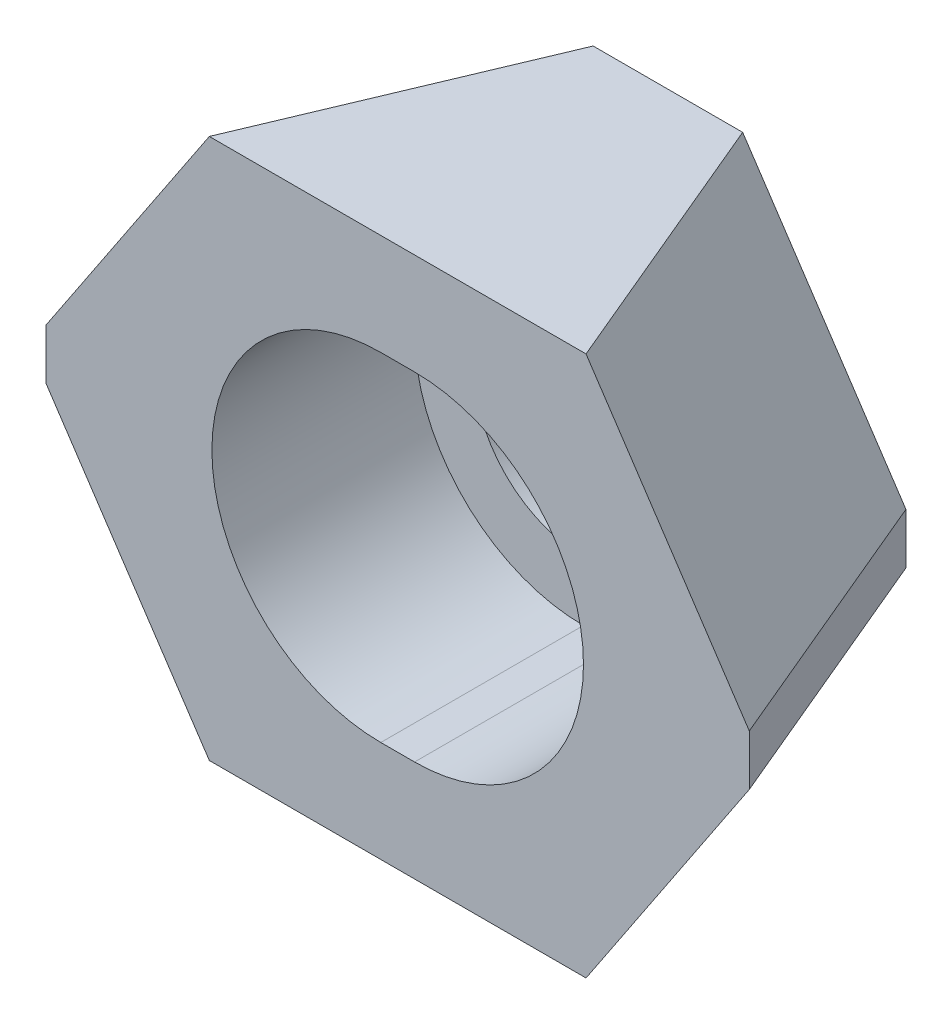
ISO-10303-21;
HEADER;
FILE_DESCRIPTION(('STEP AP214'),'2;1');
FILE_NAME('part.step','',(''),(''),'','','');
FILE_SCHEMA(('AUTOMOTIVE_DESIGN { 1 0 10303 214 1 1 1 1 }'));
ENDSEC;
DATA;
#1=APPLICATION_CONTEXT('core data for automotive mechanical design processes');
#2=APPLICATION_PROTOCOL_DEFINITION('international standard','automotive_design',2000,#1);
#3=PRODUCT_CONTEXT('',#1,'mechanical');
#4=PRODUCT('Part','Part','',(#3));
#5=PRODUCT_RELATED_PRODUCT_CATEGORY('part','',(#4));
#6=PRODUCT_DEFINITION_FORMATION('','',#4);
#7=PRODUCT_DEFINITION_CONTEXT('part definition',#1,'design');
#8=PRODUCT_DEFINITION('design','',#6,#7);
#9=PRODUCT_DEFINITION_SHAPE('','',#8);
#10=(LENGTH_UNIT() NAMED_UNIT(*) SI_UNIT(.MILLI.,.METRE.));
#11=(NAMED_UNIT(*) PLANE_ANGLE_UNIT() SI_UNIT($,.RADIAN.));
#12=(NAMED_UNIT(*) SI_UNIT($,.STERADIAN.) SOLID_ANGLE_UNIT());
#13=UNCERTAINTY_MEASURE_WITH_UNIT(LENGTH_MEASURE(1.E-05),#10,'distance_accuracy_value','');
#14=(GEOMETRIC_REPRESENTATION_CONTEXT(3) GLOBAL_UNCERTAINTY_ASSIGNED_CONTEXT((#13)) GLOBAL_UNIT_ASSIGNED_CONTEXT((#10,
#11,#12)) REPRESENTATION_CONTEXT('',''));
#15=CARTESIAN_POINT('',(0.,0.,0.));
#16=DIRECTION('',(0.,0.,1.));
#17=DIRECTION('',(1.,0.,0.));
#18=AXIS2_PLACEMENT_3D('',#15,#16,#17);
#19=CARTESIAN_POINT('',(-5.09277413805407,15.,0.));
#20=DIRECTION('',(0.,0.,-1.));
#21=DIRECTION('',(0.,1.,0.));
#22=AXIS2_PLACEMENT_3D('',#19,#20,#21);
#23=PLANE('',#22);
#24=DIRECTION('',(-0.554700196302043,-0.832050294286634,0.));
#25=VECTOR('',#24,1.);
#26=CARTESIAN_POINT('',(-5.09277413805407,15.,0.));
#27=LINE('',#26,#25);
#28=CARTESIAN_POINT('',(-4.42610747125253,16.,0.));
#29=VERTEX_POINT('',#28);
#30=CARTESIAN_POINT('',(-14.0927741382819,1.5,0.));
#31=VERTEX_POINT('',#30);
#32=EDGE_CURVE('E127',#29,#31,#27,.T.);
#33=ORIENTED_EDGE('',*,*,#32,.F.);
#34=DIRECTION('',(-1.,0.,0.));
#35=VECTOR('',#34,1.);
#36=CARTESIAN_POINT('',(5.09277413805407,16.,0.));
#37=LINE('',#36,#35);
#38=CARTESIAN_POINT('',(4.42610747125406,16.,0.));
#39=VERTEX_POINT('',#38);
#40=EDGE_CURVE('E130',#39,#29,#37,.T.);
#41=ORIENTED_EDGE('',*,*,#40,.F.);
#42=DIRECTION('',(0.554700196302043,-0.832050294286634,0.));
#43=VECTOR('',#42,1.);
#44=CARTESIAN_POINT('',(5.09277413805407,15.,0.));
#45=LINE('',#44,#43);
#46=CARTESIAN_POINT('',(14.0927741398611,1.5,0.));
#47=VERTEX_POINT('',#46);
#48=EDGE_CURVE('E35',#39,#47,#45,.T.);
#49=ORIENTED_EDGE('',*,*,#48,.T.);
#50=DIRECTION('',(0.,1.,0.));
#51=VECTOR('',#50,1.);
#52=CARTESIAN_POINT('',(14.0927741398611,-1.5,0.));
#53=LINE('',#52,#51);
#54=CARTESIAN_POINT('',(14.0927741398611,-1.5,0.));
#55=VERTEX_POINT('',#54);
#56=EDGE_CURVE('E233',#55,#47,#53,.T.);
#57=ORIENTED_EDGE('',*,*,#56,.F.);
#58=DIRECTION('',(-0.554700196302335,-0.83205029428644,0.));
#59=VECTOR('',#58,1.);
#60=CARTESIAN_POINT('',(14.0927741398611,-1.5,0.));
#61=LINE('',#60,#59);
#62=CARTESIAN_POINT('',(4.42610747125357,-16.,0.));
#63=VERTEX_POINT('',#62);
#64=EDGE_CURVE('E218',#55,#63,#61,.T.);
#65=ORIENTED_EDGE('',*,*,#64,.T.);
#66=DIRECTION('',(1.,0.,0.));
#67=VECTOR('',#66,1.);
#68=CARTESIAN_POINT('',(-5.09277413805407,-16.,0.));
#69=LINE('',#68,#67);
#70=CARTESIAN_POINT('',(-4.4261074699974,-16.,0.));
#71=VERTEX_POINT('',#70);
#72=EDGE_CURVE('E141',#71,#63,#69,.T.);
#73=ORIENTED_EDGE('',*,*,#72,.F.);
#74=DIRECTION('',(0.554700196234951,-0.832050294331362,0.));
#75=VECTOR('',#74,1.);
#76=CARTESIAN_POINT('',(-14.0927741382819,-1.5,0.));
#77=LINE('',#76,#75);
#78=CARTESIAN_POINT('',(-14.0927741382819,-1.5,0.));
#79=VERTEX_POINT('',#78);
#80=EDGE_CURVE('E217',#79,#71,#77,.T.);
#81=ORIENTED_EDGE('',*,*,#80,.F.);
#82=DIRECTION('',(0.,1.,0.));
#83=VECTOR('',#82,1.);
#84=CARTESIAN_POINT('',(-14.0927741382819,-1.5,0.));
#85=LINE('',#84,#83);
#86=EDGE_CURVE('E132',#79,#31,#85,.T.);
#87=ORIENTED_EDGE('',*,*,#86,.T.);
#88=EDGE_LOOP('',(#33,#41,#49,#57,#65,#73,#81,#87));
#89=FACE_BOUND('',#88,.T.);
#90=CARTESIAN_POINT('',(-1.,0.,0.));
#91=DIRECTION('',(0.,0.,1.));
#92=DIRECTION('',(1.,0.,0.));
#93=AXIS2_PLACEMENT_3D('',#90,#91,#92);
#94=CIRCLE('',#93,6.5);
#95=CARTESIAN_POINT('',(-1.,6.5,0.));
#96=VERTEX_POINT('',#95);
#97=CARTESIAN_POINT('',(-1.,-6.5,0.));
#98=VERTEX_POINT('',#97);
#99=EDGE_CURVE('E189',#96,#98,#94,.T.);
#100=ORIENTED_EDGE('',*,*,#99,.T.);
#101=DIRECTION('',(1.,0.,0.));
#102=VECTOR('',#101,1.);
#103=CARTESIAN_POINT('',(-1.,-6.5,0.));
#104=LINE('',#103,#102);
#105=CARTESIAN_POINT('',(1.00000000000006,-6.5,0.));
#106=VERTEX_POINT('',#105);
#107=EDGE_CURVE('E193',#98,#106,#104,.T.);
#108=ORIENTED_EDGE('',*,*,#107,.T.);
#109=CARTESIAN_POINT('',(1.,0.,0.));
#110=DIRECTION('',(0.,0.,1.));
#111=DIRECTION('',(1.,0.,0.));
#112=AXIS2_PLACEMENT_3D('',#109,#110,#111);
#113=CIRCLE('',#112,6.5);
#114=CARTESIAN_POINT('',(1.,6.5,0.));
#115=VERTEX_POINT('',#114);
#116=EDGE_CURVE('E196',#106,#115,#113,.T.);
#117=ORIENTED_EDGE('',*,*,#116,.T.);
#118=DIRECTION('',(1.,0.,0.));
#119=VECTOR('',#118,1.);
#120=CARTESIAN_POINT('',(-1.,6.5,0.));
#121=LINE('',#120,#119);
#122=EDGE_CURVE('E188',#96,#115,#121,.T.);
#123=ORIENTED_EDGE('',*,*,#122,.F.);
#124=EDGE_LOOP('',(#100,#108,#117,#123));
#125=FACE_BOUND('',#124,.T.);
#126=ADVANCED_FACE('F14',(#89,#125),#23,.T.);
#127=CARTESIAN_POINT('',(11.8185548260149,15.,16.));
#128=DIRECTION('',(0.,0.,1.));
#129=DIRECTION('',(1.,0.,0.));
#130=AXIS2_PLACEMENT_3D('',#127,#128,#129);
#131=PLANE('',#130);
#132=DIRECTION('',(1.,0.,0.));
#133=VECTOR('',#132,1.);
#134=CARTESIAN_POINT('',(-11.8185548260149,16.,16.));
#135=LINE('',#134,#133);
#136=CARTESIAN_POINT('',(-11.1518881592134,16.,16.));
#137=VERTEX_POINT('',#136);
#138=CARTESIAN_POINT('',(11.1518881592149,16.,16.));
#139=VERTEX_POINT('',#138);
#140=EDGE_CURVE('E140',#137,#139,#135,.T.);
#141=ORIENTED_EDGE('',*,*,#140,.F.);
#142=DIRECTION('',(-0.55470019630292,-0.83205029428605,0.));
#143=VECTOR('',#142,1.);
#144=CARTESIAN_POINT('',(-11.8185548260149,15.,16.));
#145=LINE('',#144,#143);
#146=CARTESIAN_POINT('',(-20.8185548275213,1.5,16.));
#147=VERTEX_POINT('',#146);
#148=EDGE_CURVE('E27',#137,#147,#145,.T.);
#149=ORIENTED_EDGE('',*,*,#148,.T.);
#150=DIRECTION('',(0.,1.,0.));
#151=VECTOR('',#150,1.);
#152=CARTESIAN_POINT('',(-20.8185548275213,-1.5,16.));
#153=LINE('',#152,#151);
#154=CARTESIAN_POINT('',(-20.8185548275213,-1.5,16.));
#155=VERTEX_POINT('',#154);
#156=EDGE_CURVE('E225',#155,#147,#153,.T.);
#157=ORIENTED_EDGE('',*,*,#156,.F.);
#158=DIRECTION('',(0.554700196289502,-0.832050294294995,0.));
#159=VECTOR('',#158,1.);
#160=CARTESIAN_POINT('',(-20.8185548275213,-1.5,16.));
#161=LINE('',#160,#159);
#162=CARTESIAN_POINT('',(-11.1518881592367,-16.,16.));
#163=VERTEX_POINT('',#162);
#164=EDGE_CURVE('E212',#155,#163,#161,.T.);
#165=ORIENTED_EDGE('',*,*,#164,.T.);
#166=DIRECTION('',(-1.,0.,0.));
#167=VECTOR('',#166,1.);
#168=CARTESIAN_POINT('',(11.8185548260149,-16.,16.));
#169=LINE('',#168,#167);
#170=CARTESIAN_POINT('',(11.1518881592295,-16.,16.));
#171=VERTEX_POINT('',#170);
#172=EDGE_CURVE('E146',#171,#163,#169,.T.);
#173=ORIENTED_EDGE('',*,*,#172,.F.);
#174=DIRECTION('',(-0.554700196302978,-0.832050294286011,0.));
#175=VECTOR('',#174,1.);
#176=CARTESIAN_POINT('',(20.8185548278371,-1.5,16.));
#177=LINE('',#176,#175);
#178=CARTESIAN_POINT('',(20.8185548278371,-1.5,16.));
#179=VERTEX_POINT('',#178);
#180=EDGE_CURVE('E215',#179,#171,#177,.T.);
#181=ORIENTED_EDGE('',*,*,#180,.F.);
#182=DIRECTION('',(0.,1.,0.));
#183=VECTOR('',#182,1.);
#184=CARTESIAN_POINT('',(20.8185548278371,-1.5,16.));
#185=LINE('',#184,#183);
#186=CARTESIAN_POINT('',(20.8185548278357,1.5,16.));
#187=VERTEX_POINT('',#186);
#188=EDGE_CURVE('E230',#179,#187,#185,.T.);
#189=ORIENTED_EDGE('',*,*,#188,.T.);
#190=DIRECTION('',(0.55470019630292,-0.83205029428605,0.));
#191=VECTOR('',#190,1.);
#192=CARTESIAN_POINT('',(11.8185548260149,15.,16.));
#193=LINE('',#192,#191);
#194=EDGE_CURVE('E134',#139,#187,#193,.T.);
#195=ORIENTED_EDGE('',*,*,#194,.F.);
#196=EDGE_LOOP('',(#141,#149,#157,#165,#173,#181,#189,#195));
#197=FACE_BOUND('',#196,.T.);
#198=CARTESIAN_POINT('',(-1.,0.,16.));
#199=DIRECTION('',(0.,0.,1.));
#200=DIRECTION('',(1.,0.,0.));
#201=AXIS2_PLACEMENT_3D('',#198,#199,#200);
#202=CIRCLE('',#201,10.);
#203=CARTESIAN_POINT('',(-1.,10.,16.));
#204=VERTEX_POINT('',#203);
#205=CARTESIAN_POINT('',(-1.,-10.,16.));
#206=VERTEX_POINT('',#205);
#207=EDGE_CURVE('E150',#204,#206,#202,.T.);
#208=ORIENTED_EDGE('',*,*,#207,.F.);
#209=DIRECTION('',(1.,0.,0.));
#210=VECTOR('',#209,1.);
#211=CARTESIAN_POINT('',(-1.,10.,16.));
#212=LINE('',#211,#210);
#213=CARTESIAN_POINT('',(1.,10.,16.));
#214=VERTEX_POINT('',#213);
#215=EDGE_CURVE('E143',#204,#214,#212,.T.);
#216=ORIENTED_EDGE('',*,*,#215,.T.);
#217=CARTESIAN_POINT('',(1.,0.,16.));
#218=DIRECTION('',(0.,0.,1.));
#219=DIRECTION('',(1.,0.,0.));
#220=AXIS2_PLACEMENT_3D('',#217,#218,#219);
#221=CIRCLE('',#220,10.);
#222=CARTESIAN_POINT('',(1.,-10.,16.));
#223=VERTEX_POINT('',#222);
#224=EDGE_CURVE('E156',#223,#214,#221,.T.);
#225=ORIENTED_EDGE('',*,*,#224,.F.);
#226=DIRECTION('',(1.,0.,0.));
#227=VECTOR('',#226,1.);
#228=CARTESIAN_POINT('',(-1.,-10.,16.));
#229=LINE('',#228,#227);
#230=EDGE_CURVE('E153',#206,#223,#229,.T.);
#231=ORIENTED_EDGE('',*,*,#230,.F.);
#232=EDGE_LOOP('',(#208,#216,#225,#231));
#233=FACE_BOUND('',#232,.T.);
#234=ADVANCED_FACE('F259',(#197,#233),#131,.T.);
#235=CARTESIAN_POINT('',(0.,-16.,0.));
#236=DIRECTION('',(0.,-1.,0.));
#237=DIRECTION('',(0.,0.,-1.));
#238=AXIS2_PLACEMENT_3D('',#235,#236,#237);
#239=PLANE('',#238);
#240=ORIENTED_EDGE('',*,*,#72,.T.);
#241=DIRECTION('',(0.38751558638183,0.,0.921863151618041));
#242=VECTOR('',#241,1.);
#243=CARTESIAN_POINT('',(3.76144630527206,-16.,-1.58116643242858));
#244=LINE('',#243,#242);
#245=EDGE_CURVE('E249',#63,#171,#244,.T.);
#246=ORIENTED_EDGE('',*,*,#245,.T.);
#247=ORIENTED_EDGE('',*,*,#172,.T.);
#248=DIRECTION('',(-0.387515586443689,0.,0.921863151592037));
#249=VECTOR('',#248,1.);
#250=CARTESIAN_POINT('',(-3.76144630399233,-16.,-1.58116643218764));
#251=LINE('',#250,#249);
#252=EDGE_CURVE('E246',#71,#163,#251,.T.);
#253=ORIENTED_EDGE('',*,*,#252,.F.);
#254=EDGE_LOOP('',(#240,#246,#247,#253));
#255=FACE_BOUND('',#254,.T.);
#256=ADVANCED_FACE('F269',(#255),#239,.T.);
#257=CARTESIAN_POINT('',(-1.,0.,0.));
#258=DIRECTION('',(0.,0.,1.));
#259=DIRECTION('',(1.,0.,0.));
#260=AXIS2_PLACEMENT_3D('',#257,#258,#259);
#261=CYLINDRICAL_SURFACE('',#260,6.5);
#262=CARTESIAN_POINT('',(-1.,0.,4.));
#263=DIRECTION('',(0.,0.,1.));
#264=DIRECTION('',(1.,0.,0.));
#265=AXIS2_PLACEMENT_3D('',#262,#263,#264);
#266=CIRCLE('',#265,6.5);
#267=CARTESIAN_POINT('',(-1.,-6.5,4.));
#268=VERTEX_POINT('',#267);
#269=CARTESIAN_POINT('',(-1.,6.5,4.));
#270=VERTEX_POINT('',#269);
#271=EDGE_CURVE('E186',#268,#270,#266,.F.);
#272=ORIENTED_EDGE('',*,*,#271,.F.);
#273=DIRECTION('',(0.,0.,1.));
#274=VECTOR('',#273,1.);
#275=CARTESIAN_POINT('',(-1.,-6.5,0.));
#276=LINE('',#275,#274);
#277=EDGE_CURVE('E192',#98,#268,#276,.T.);
#278=ORIENTED_EDGE('',*,*,#277,.F.);
#279=ORIENTED_EDGE('',*,*,#99,.F.);
#280=DIRECTION('',(0.,0.,1.));
#281=VECTOR('',#280,1.);
#282=CARTESIAN_POINT('',(-1.,6.5,0.));
#283=LINE('',#282,#281);
#284=EDGE_CURVE('E209',#96,#270,#283,.T.);
#285=ORIENTED_EDGE('',*,*,#284,.T.);
#286=EDGE_LOOP('',(#272,#278,#279,#285));
#287=FACE_BOUND('',#286,.T.);
#288=ADVANCED_FACE('F299',(#287),#261,.F.);
#289=CARTESIAN_POINT('',(-1.,6.5,0.));
#290=DIRECTION('',(0.,-1.,0.));
#291=DIRECTION('',(1.,0.,0.));
#292=AXIS2_PLACEMENT_3D('',#289,#290,#291);
#293=PLANE('',#292);
#294=DIRECTION('',(0.,0.,1.));
#295=VECTOR('',#294,1.);
#296=CARTESIAN_POINT('',(1.,6.5,0.));
#297=LINE('',#296,#295);
#298=CARTESIAN_POINT('',(1.,6.5,4.));
#299=VERTEX_POINT('',#298);
#300=EDGE_CURVE('E206',#115,#299,#297,.T.);
#301=ORIENTED_EDGE('',*,*,#300,.T.);
#302=DIRECTION('',(-1.,0.,0.));
#303=VECTOR('',#302,1.);
#304=CARTESIAN_POINT('',(-1.,6.5,4.));
#305=LINE('',#304,#303);
#306=EDGE_CURVE('E183',#299,#270,#305,.T.);
#307=ORIENTED_EDGE('',*,*,#306,.T.);
#308=ORIENTED_EDGE('',*,*,#284,.F.);
#309=ORIENTED_EDGE('',*,*,#122,.T.);
#310=EDGE_LOOP('',(#301,#307,#308,#309));
#311=FACE_BOUND('',#310,.T.);
#312=ADVANCED_FACE('F305',(#311),#293,.T.);
#313=CARTESIAN_POINT('',(1.,0.,0.));
#314=DIRECTION('',(0.,0.,1.));
#315=DIRECTION('',(1.,0.,0.));
#316=AXIS2_PLACEMENT_3D('',#313,#314,#315);
#317=CYLINDRICAL_SURFACE('',#316,6.5);
#318=CARTESIAN_POINT('',(1.,0.,4.));
#319=DIRECTION('',(0.,0.,1.));
#320=DIRECTION('',(1.,0.,0.));
#321=AXIS2_PLACEMENT_3D('',#318,#319,#320);
#322=CIRCLE('',#321,6.5);
#323=CARTESIAN_POINT('',(1.00000000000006,-6.5,4.));
#324=VERTEX_POINT('',#323);
#325=EDGE_CURVE('E181',#299,#324,#322,.F.);
#326=ORIENTED_EDGE('',*,*,#325,.F.);
#327=ORIENTED_EDGE('',*,*,#300,.F.);
#328=ORIENTED_EDGE('',*,*,#116,.F.);
#329=DIRECTION('',(0.,0.,1.));
#330=VECTOR('',#329,1.);
#331=CARTESIAN_POINT('',(1.00000000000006,-6.5,0.));
#332=LINE('',#331,#330);
#333=EDGE_CURVE('E203',#106,#324,#332,.T.);
#334=ORIENTED_EDGE('',*,*,#333,.T.);
#335=EDGE_LOOP('',(#326,#327,#328,#334));
#336=FACE_BOUND('',#335,.T.);
#337=ADVANCED_FACE('F333',(#336),#317,.F.);
#338=CARTESIAN_POINT('',(-1.,-6.5,0.));
#339=DIRECTION('',(0.,-1.,0.));
#340=DIRECTION('',(1.,0.,0.));
#341=AXIS2_PLACEMENT_3D('',#338,#339,#340);
#342=PLANE('',#341);
#343=DIRECTION('',(-1.,0.,0.));
#344=VECTOR('',#343,1.);
#345=CARTESIAN_POINT('',(-1.,-6.5,4.));
#346=LINE('',#345,#344);
#347=EDGE_CURVE('E243',#324,#268,#346,.T.);
#348=ORIENTED_EDGE('',*,*,#347,.F.);
#349=ORIENTED_EDGE('',*,*,#333,.F.);
#350=ORIENTED_EDGE('',*,*,#107,.F.);
#351=ORIENTED_EDGE('',*,*,#277,.T.);
#352=EDGE_LOOP('',(#348,#349,#350,#351));
#353=FACE_BOUND('',#352,.T.);
#354=ADVANCED_FACE('F286',(#353),#342,.F.);
#355=CARTESIAN_POINT('',(5.09277413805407,15.,0.));
#356=DIRECTION('',(0.785395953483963,0.523597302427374,-0.330150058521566));
#357=DIRECTION('',(-0.554700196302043,0.832050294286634,0.));
#358=AXIS2_PLACEMENT_3D('',#355,#356,#357);
#359=PLANE('',#358);
#360=ORIENTED_EDGE('',*,*,#194,.T.);
#361=DIRECTION('',(-0.387515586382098,0.,-0.921863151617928));
#362=VECTOR('',#361,1.);
#363=CARTESIAN_POINT('',(20.8185548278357,1.5,16.));
#364=LINE('',#363,#362);
#365=EDGE_CURVE('E238',#187,#47,#364,.T.);
#366=ORIENTED_EDGE('',*,*,#365,.T.);
#367=ORIENTED_EDGE('',*,*,#48,.F.);
#368=DIRECTION('',(0.387515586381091,0.,0.921863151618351));
#369=VECTOR('',#368,1.);
#370=CARTESIAN_POINT('',(3.76144630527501,16.,-1.58116643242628));
#371=LINE('',#370,#369);
#372=EDGE_CURVE('E21',#39,#139,#371,.T.);
#373=ORIENTED_EDGE('',*,*,#372,.T.);
#374=EDGE_LOOP('',(#360,#366,#367,#373));
#375=FACE_BOUND('',#374,.T.);
#376=ADVANCED_FACE('F251',(#375),#359,.T.);
#377=CARTESIAN_POINT('',(-11.8185548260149,15.,16.));
#378=DIRECTION('',(-0.785395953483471,0.523597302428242,-0.33015005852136));
#379=DIRECTION('',(-0.55470019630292,-0.83205029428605,0.));
#380=AXIS2_PLACEMENT_3D('',#377,#378,#379);
#381=PLANE('',#380);
#382=ORIENTED_EDGE('',*,*,#32,.T.);
#383=DIRECTION('',(0.387515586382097,0.,-0.921863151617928));
#384=VECTOR('',#383,1.);
#385=CARTESIAN_POINT('',(-20.8185548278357,1.5,16.));
#386=LINE('',#385,#384);
#387=EDGE_CURVE('E237',#147,#31,#386,.T.);
#388=ORIENTED_EDGE('',*,*,#387,.F.);
#389=ORIENTED_EDGE('',*,*,#148,.F.);
#390=DIRECTION('',(0.387515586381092,0.,-0.921863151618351));
#391=VECTOR('',#390,1.);
#392=CARTESIAN_POINT('',(-3.76144630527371,16.,-1.58116643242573));
#393=LINE('',#392,#391);
#394=EDGE_CURVE('E9',#137,#29,#393,.T.);
#395=ORIENTED_EDGE('',*,*,#394,.T.);
#396=EDGE_LOOP('',(#382,#388,#389,#395));
#397=FACE_BOUND('',#396,.T.);
#398=ADVANCED_FACE('F136',(#397),#381,.T.);
#399=CARTESIAN_POINT('',(-20.8185548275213,-1.5,16.));
#400=DIRECTION('',(0.921863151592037,0.,0.387515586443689));
#401=DIRECTION('',(0.387515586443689,0.,-0.921863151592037));
#402=AXIS2_PLACEMENT_3D('',#399,#400,#401);
#403=PLANE('',#402);
#404=ORIENTED_EDGE('',*,*,#86,.F.);
#405=DIRECTION('',(0.387515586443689,0.,-0.921863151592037));
#406=VECTOR('',#405,1.);
#407=CARTESIAN_POINT('',(-20.8185548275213,-1.5,16.));
#408=LINE('',#407,#406);
#409=EDGE_CURVE('E222',#155,#79,#408,.T.);
#410=ORIENTED_EDGE('',*,*,#409,.F.);
#411=ORIENTED_EDGE('',*,*,#156,.T.);
#412=ORIENTED_EDGE('',*,*,#387,.T.);
#413=EDGE_LOOP('',(#404,#410,#411,#412));
#414=FACE_BOUND('',#413,.T.);
#415=ADVANCED_FACE('F275',(#414),#403,.F.);
#416=CARTESIAN_POINT('',(20.8185548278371,-1.5,16.));
#417=DIRECTION('',(0.92186315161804,0.,-0.38751558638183));
#418=DIRECTION('',(-0.38751558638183,0.,-0.921863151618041));
#419=AXIS2_PLACEMENT_3D('',#416,#417,#418);
#420=PLANE('',#419);
#421=ORIENTED_EDGE('',*,*,#188,.F.);
#422=DIRECTION('',(-0.38751558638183,0.,-0.921863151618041));
#423=VECTOR('',#422,1.);
#424=CARTESIAN_POINT('',(20.8185548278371,-1.5,16.));
#425=LINE('',#424,#423);
#426=EDGE_CURVE('E220',#179,#55,#425,.T.);
#427=ORIENTED_EDGE('',*,*,#426,.T.);
#428=ORIENTED_EDGE('',*,*,#56,.T.);
#429=ORIENTED_EDGE('',*,*,#365,.F.);
#430=EDGE_LOOP('',(#421,#427,#428,#429));
#431=FACE_BOUND('',#430,.T.);
#432=ADVANCED_FACE('F257',(#431),#420,.T.);
#433=CARTESIAN_POINT('',(14.0927741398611,-1.5,0.));
#434=DIRECTION('',(0.785395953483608,-0.523597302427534,-0.330150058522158));
#435=DIRECTION('',(0.554700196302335,0.83205029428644,0.));
#436=AXIS2_PLACEMENT_3D('',#433,#434,#435);
#437=PLANE('',#436);
#438=ORIENTED_EDGE('',*,*,#245,.F.);
#439=ORIENTED_EDGE('',*,*,#64,.F.);
#440=ORIENTED_EDGE('',*,*,#426,.F.);
#441=ORIENTED_EDGE('',*,*,#180,.T.);
#442=EDGE_LOOP('',(#438,#439,#440,#441));
#443=FACE_BOUND('',#442,.T.);
#444=ADVANCED_FACE('F265',(#443),#437,.T.);
#445=CARTESIAN_POINT('',(-20.8185548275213,-1.5,16.));
#446=DIRECTION('',(-0.785395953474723,-0.523597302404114,-0.330150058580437));
#447=DIRECTION('',(0.554700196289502,-0.832050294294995,0.));
#448=AXIS2_PLACEMENT_3D('',#445,#446,#447);
#449=PLANE('',#448);
#450=ORIENTED_EDGE('',*,*,#252,.T.);
#451=ORIENTED_EDGE('',*,*,#164,.F.);
#452=ORIENTED_EDGE('',*,*,#409,.T.);
#453=ORIENTED_EDGE('',*,*,#80,.T.);
#454=EDGE_LOOP('',(#450,#451,#452,#453));
#455=FACE_BOUND('',#454,.T.);
#456=ADVANCED_FACE('F271',(#455),#449,.T.);
#457=CARTESIAN_POINT('',(-1.,0.,4.));
#458=DIRECTION('',(0.,0.,1.));
#459=DIRECTION('',(1.,0.,0.));
#460=AXIS2_PLACEMENT_3D('',#457,#458,#459);
#461=PLANE('',#460);
#462=CARTESIAN_POINT('',(-1.,0.,4.));
#463=DIRECTION('',(0.,0.,1.));
#464=DIRECTION('',(1.,0.,0.));
#465=AXIS2_PLACEMENT_3D('',#462,#463,#464);
#466=CIRCLE('',#465,10.);
#467=CARTESIAN_POINT('',(-1.,10.,4.));
#468=VERTEX_POINT('',#467);
#469=CARTESIAN_POINT('',(-1.,-10.,4.));
#470=VERTEX_POINT('',#469);
#471=EDGE_CURVE('E161',#468,#470,#466,.T.);
#472=ORIENTED_EDGE('',*,*,#471,.T.);
#473=DIRECTION('',(1.,0.,0.));
#474=VECTOR('',#473,1.);
#475=CARTESIAN_POINT('',(-1.,-10.,4.));
#476=LINE('',#475,#474);
#477=CARTESIAN_POINT('',(1.,-10.,4.));
#478=VERTEX_POINT('',#477);
#479=EDGE_CURVE('E165',#470,#478,#476,.T.);
#480=ORIENTED_EDGE('',*,*,#479,.T.);
#481=CARTESIAN_POINT('',(1.,0.,4.));
#482=DIRECTION('',(0.,0.,1.));
#483=DIRECTION('',(1.,0.,0.));
#484=AXIS2_PLACEMENT_3D('',#481,#482,#483);
#485=CIRCLE('',#484,10.);
#486=CARTESIAN_POINT('',(1.,10.,4.));
#487=VERTEX_POINT('',#486);
#488=EDGE_CURVE('E168',#478,#487,#485,.T.);
#489=ORIENTED_EDGE('',*,*,#488,.T.);
#490=DIRECTION('',(1.,0.,0.));
#491=VECTOR('',#490,1.);
#492=CARTESIAN_POINT('',(-1.,10.,4.));
#493=LINE('',#492,#491);
#494=EDGE_CURVE('E152',#468,#487,#493,.T.);
#495=ORIENTED_EDGE('',*,*,#494,.F.);
#496=EDGE_LOOP('',(#472,#480,#489,#495));
#497=FACE_BOUND('',#496,.T.);
#498=ORIENTED_EDGE('',*,*,#271,.T.);
#499=ORIENTED_EDGE('',*,*,#306,.F.);
#500=ORIENTED_EDGE('',*,*,#325,.T.);
#501=ORIENTED_EDGE('',*,*,#347,.T.);
#502=EDGE_LOOP('',(#498,#499,#500,#501));
#503=FACE_BOUND('',#502,.T.);
#504=ADVANCED_FACE('F312',(#497,#503),#461,.T.);
#505=CARTESIAN_POINT('',(-1.,0.,4.));
#506=DIRECTION('',(0.,0.,1.));
#507=DIRECTION('',(1.,0.,0.));
#508=AXIS2_PLACEMENT_3D('',#505,#506,#507);
#509=CYLINDRICAL_SURFACE('',#508,10.);
#510=DIRECTION('',(0.,0.,1.));
#511=VECTOR('',#510,1.);
#512=CARTESIAN_POINT('',(-1.,10.,4.));
#513=LINE('',#512,#511);
#514=EDGE_CURVE('E179',#468,#204,#513,.T.);
#515=ORIENTED_EDGE('',*,*,#514,.T.);
#516=ORIENTED_EDGE('',*,*,#207,.T.);
#517=DIRECTION('',(0.,0.,1.));
#518=VECTOR('',#517,1.);
#519=CARTESIAN_POINT('',(-1.,-10.,4.));
#520=LINE('',#519,#518);
#521=EDGE_CURVE('E164',#470,#206,#520,.T.);
#522=ORIENTED_EDGE('',*,*,#521,.F.);
#523=ORIENTED_EDGE('',*,*,#471,.F.);
#524=EDGE_LOOP('',(#515,#516,#522,#523));
#525=FACE_BOUND('',#524,.T.);
#526=ADVANCED_FACE('F315',(#525),#509,.F.);
#527=CARTESIAN_POINT('',(-1.,10.,4.));
#528=DIRECTION('',(0.,-1.,0.));
#529=DIRECTION('',(0.,0.,-1.));
#530=AXIS2_PLACEMENT_3D('',#527,#528,#529);
#531=PLANE('',#530);
#532=DIRECTION('',(0.,0.,1.));
#533=VECTOR('',#532,1.);
#534=CARTESIAN_POINT('',(1.,10.,4.));
#535=LINE('',#534,#533);
#536=EDGE_CURVE('E177',#487,#214,#535,.T.);
#537=ORIENTED_EDGE('',*,*,#536,.T.);
#538=ORIENTED_EDGE('',*,*,#215,.F.);
#539=ORIENTED_EDGE('',*,*,#514,.F.);
#540=ORIENTED_EDGE('',*,*,#494,.T.);
#541=EDGE_LOOP('',(#537,#538,#539,#540));
#542=FACE_BOUND('',#541,.T.);
#543=ADVANCED_FACE('F319',(#542),#531,.T.);
#544=CARTESIAN_POINT('',(1.,0.,4.));
#545=DIRECTION('',(0.,0.,1.));
#546=DIRECTION('',(1.,0.,0.));
#547=AXIS2_PLACEMENT_3D('',#544,#545,#546);
#548=CYLINDRICAL_SURFACE('',#547,10.);
#549=DIRECTION('',(0.,0.,1.));
#550=VECTOR('',#549,1.);
#551=CARTESIAN_POINT('',(1.,-10.,4.));
#552=LINE('',#551,#550);
#553=EDGE_CURVE('E175',#478,#223,#552,.T.);
#554=ORIENTED_EDGE('',*,*,#553,.T.);
#555=ORIENTED_EDGE('',*,*,#224,.T.);
#556=ORIENTED_EDGE('',*,*,#536,.F.);
#557=ORIENTED_EDGE('',*,*,#488,.F.);
#558=EDGE_LOOP('',(#554,#555,#556,#557));
#559=FACE_BOUND('',#558,.T.);
#560=ADVANCED_FACE('F323',(#559),#548,.F.);
#561=CARTESIAN_POINT('',(-1.,-10.,4.));
#562=DIRECTION('',(0.,-1.,0.));
#563=DIRECTION('',(0.,0.,-1.));
#564=AXIS2_PLACEMENT_3D('',#561,#562,#563);
#565=PLANE('',#564);
#566=ORIENTED_EDGE('',*,*,#479,.F.);
#567=ORIENTED_EDGE('',*,*,#521,.T.);
#568=ORIENTED_EDGE('',*,*,#230,.T.);
#569=ORIENTED_EDGE('',*,*,#553,.F.);
#570=EDGE_LOOP('',(#566,#567,#568,#569));
#571=FACE_BOUND('',#570,.T.);
#572=ADVANCED_FACE('F311',(#571),#565,.F.);
#573=CARTESIAN_POINT('',(0.,16.,0.));
#574=DIRECTION('',(0.,1.,0.));
#575=DIRECTION('',(0.,0.,1.));
#576=AXIS2_PLACEMENT_3D('',#573,#574,#575);
#577=PLANE('',#576);
#578=ORIENTED_EDGE('',*,*,#394,.F.);
#579=ORIENTED_EDGE('',*,*,#140,.T.);
#580=ORIENTED_EDGE('',*,*,#372,.F.);
#581=ORIENTED_EDGE('',*,*,#40,.T.);
#582=EDGE_LOOP('',(#578,#579,#580,#581));
#583=FACE_BOUND('',#582,.T.);
#584=ADVANCED_FACE('F139',(#583),#577,.T.);
#585=CLOSED_SHELL('',(#126,#234,#256,#288,#312,#337,#354,#376,#398,#415,#432,#444,#456,#504,
#526,#543,#560,#572,#584));
#586=MANIFOLD_SOLID_BREP('B1',#585);
#587=ADVANCED_BREP_SHAPE_REPRESENTATION('',(#18,#586),#14);
#588=SHAPE_DEFINITION_REPRESENTATION(#9,#587);
ENDSEC;
END-ISO-10303-21;
